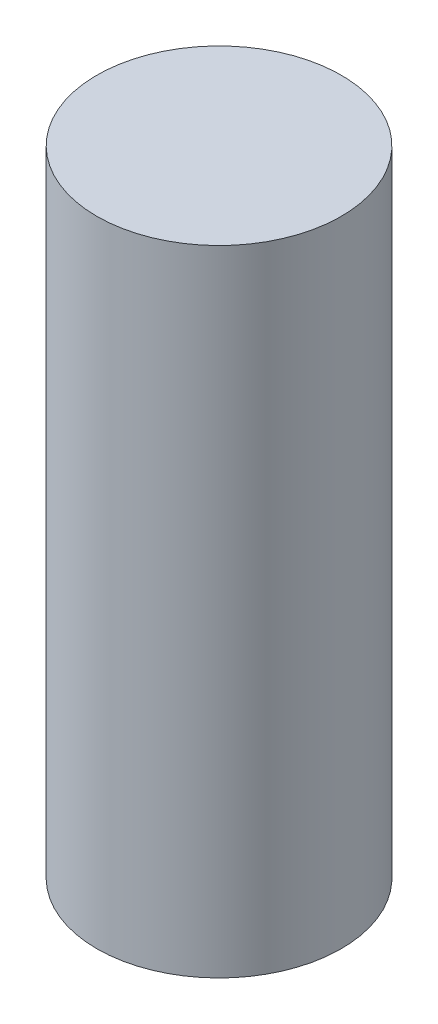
from build123d import *

# Parameters (mm, degrees)
SKETCH1_R           = 9.25
BOSS_EXTRUDE1_DEPTH = 48


with BuildPart() as part:
    # Sketch1 → Boss-Extrude1 (new body)
    with BuildSketch(Plane(origin=(0, 0, 0), x_dir=(1, 0, 0), z_dir=(0, 1, 0))):
        with Locations(Location((0, 0, 0), (0, 0, 270))):
            Circle(SKETCH1_R)
    extrude(amount=BOSS_EXTRUDE1_DEPTH)


solid = part.part
